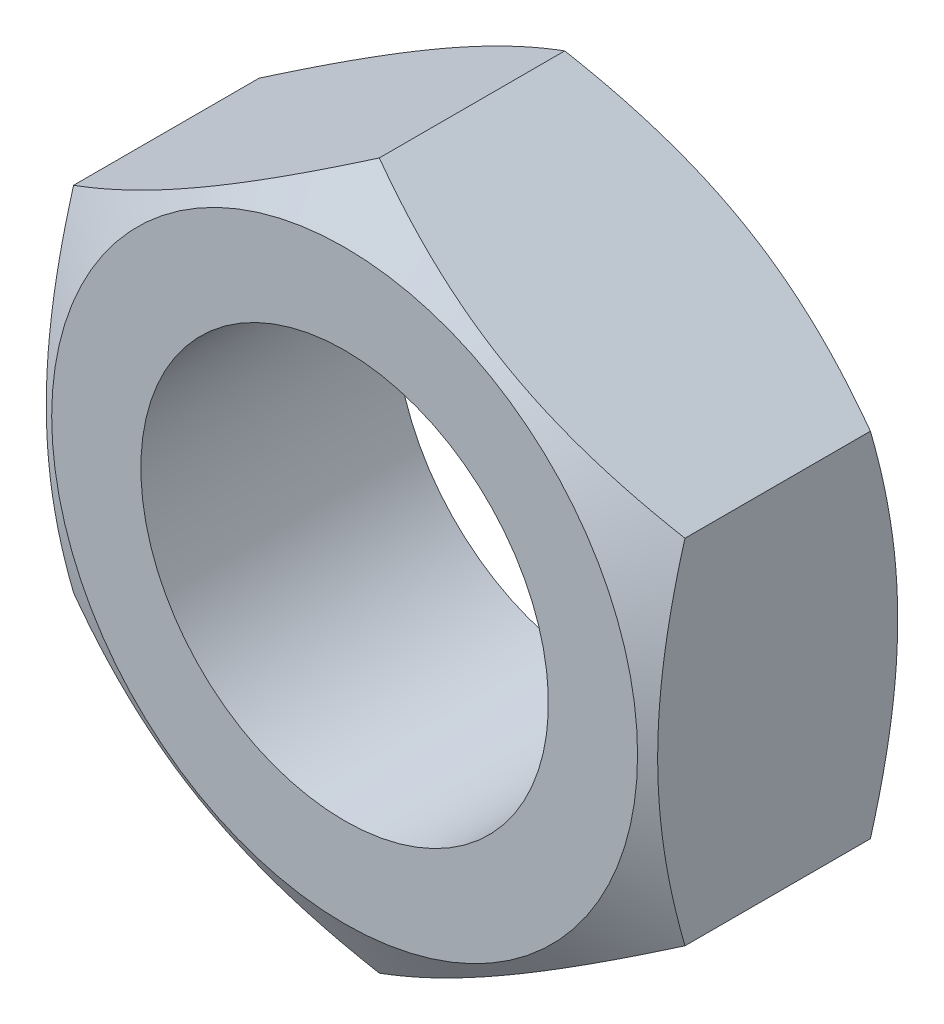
ISO-10303-21;
HEADER;
FILE_DESCRIPTION(('STEP AP214'),'2;1');
FILE_NAME('part.step','',(''),(''),'','','');
FILE_SCHEMA(('AUTOMOTIVE_DESIGN { 1 0 10303 214 1 1 1 1 }'));
ENDSEC;
DATA;
#1=APPLICATION_CONTEXT('core data for automotive mechanical design processes');
#2=APPLICATION_PROTOCOL_DEFINITION('international standard','automotive_design',2000,#1);
#3=PRODUCT_CONTEXT('',#1,'mechanical');
#4=PRODUCT('Part','Part','',(#3));
#5=PRODUCT_RELATED_PRODUCT_CATEGORY('part','',(#4));
#6=PRODUCT_DEFINITION_FORMATION('','',#4);
#7=PRODUCT_DEFINITION_CONTEXT('part definition',#1,'design');
#8=PRODUCT_DEFINITION('design','',#6,#7);
#9=PRODUCT_DEFINITION_SHAPE('','',#8);
#10=(LENGTH_UNIT() NAMED_UNIT(*) SI_UNIT(.MILLI.,.METRE.));
#11=(NAMED_UNIT(*) PLANE_ANGLE_UNIT() SI_UNIT($,.RADIAN.));
#12=(NAMED_UNIT(*) SI_UNIT($,.STERADIAN.) SOLID_ANGLE_UNIT());
#13=UNCERTAINTY_MEASURE_WITH_UNIT(LENGTH_MEASURE(1.E-05),#10,'distance_accuracy_value','');
#14=(GEOMETRIC_REPRESENTATION_CONTEXT(3) GLOBAL_UNCERTAINTY_ASSIGNED_CONTEXT((#13)) GLOBAL_UNIT_ASSIGNED_CONTEXT((#10,
#11,#12)) REPRESENTATION_CONTEXT('',''));
#15=CARTESIAN_POINT('',(0.,0.,0.));
#16=DIRECTION('',(0.,0.,1.));
#17=DIRECTION('',(1.,0.,0.));
#18=AXIS2_PLACEMENT_3D('',#15,#16,#17);
#19=CARTESIAN_POINT('',(-12.,6.92820323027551,0.));
#20=DIRECTION('',(0.,0.,-1.));
#21=DIRECTION('',(0.,-1.,0.));
#22=AXIS2_PLACEMENT_3D('',#19,#20,#21);
#23=PLANE('',#22);
#24=CARTESIAN_POINT('',(0.,0.,0.));
#25=DIRECTION('',(0.,0.,-1.));
#26=DIRECTION('',(0.,-1.,0.));
#27=AXIS2_PLACEMENT_3D('',#24,#25,#26);
#28=CIRCLE('',#27,11.5);
#29=CARTESIAN_POINT('',(0.,-11.5,0.));
#30=VERTEX_POINT('',#29);
#31=EDGE_CURVE('E81',#30,#30,#28,.T.);
#32=ORIENTED_EDGE('',*,*,#31,.T.);
#33=EDGE_LOOP('',(#32));
#34=FACE_BOUND('',#33,.T.);
#35=CARTESIAN_POINT('',(0.,0.,0.));
#36=DIRECTION('',(0.,0.,1.));
#37=DIRECTION('',(0.,1.,0.));
#38=AXIS2_PLACEMENT_3D('',#35,#36,#37);
#39=CIRCLE('',#38,8.);
#40=CARTESIAN_POINT('',(0.,8.,0.));
#41=VERTEX_POINT('',#40);
#42=EDGE_CURVE('E88',#41,#41,#39,.T.);
#43=ORIENTED_EDGE('',*,*,#42,.T.);
#44=EDGE_LOOP('',(#43));
#45=FACE_BOUND('',#44,.T.);
#46=ADVANCED_FACE('F14',(#34,#45),#23,.T.);
#47=CARTESIAN_POINT('',(-12.,-6.92820323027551,13.));
#48=DIRECTION('',(-1.,0.,0.));
#49=DIRECTION('',(0.,0.,1.));
#50=AXIS2_PLACEMENT_3D('',#47,#48,#49);
#51=PLANE('',#50);
#52=CARTESIAN_POINT('',(-12.,-18.5608751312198,3.87883211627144));
#53=CARTESIAN_POINT('',(-12.,-18.2990281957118,4.00578473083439));
#54=CARTESIAN_POINT('',(-12.,-18.0368726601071,4.13210053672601));
#55=CARTESIAN_POINT('',(-12.,-17.51187996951,4.38331420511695));
#56=CARTESIAN_POINT('',(-12.,-17.2490428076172,4.50821205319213));
#57=CARTESIAN_POINT('',(-12.,-16.4593415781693,4.88059540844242));
#58=CARTESIAN_POINT('',(-12.,-15.9313659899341,5.12573269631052));
#59=CARTESIAN_POINT('',(-12.,-14.868968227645,5.60958390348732));
#60=CARTESIAN_POINT('',(-12.,-14.3345265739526,5.84825515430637));
#61=CARTESIAN_POINT('',(-12.,-13.261375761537,6.31576827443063));
#62=CARTESIAN_POINT('',(-12.,-12.7226668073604,6.5446106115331));
#63=CARTESIAN_POINT('',(-12.,-11.6229344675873,6.99693350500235));
#64=CARTESIAN_POINT('',(-12.,-11.0617454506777,7.22001347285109));
#65=CARTESIAN_POINT('',(-12.,-9.93277977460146,7.64917136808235));
#66=CARTESIAN_POINT('',(-12.,-9.36500238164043,7.85524738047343));
#67=CARTESIAN_POINT('',(-12.,-8.22305398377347,8.24494848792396));
#68=CARTESIAN_POINT('',(-12.,-7.64889876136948,8.4286194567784));
#69=CARTESIAN_POINT('',(-12.,-6.49229808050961,8.76759444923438));
#70=CARTESIAN_POINT('',(-12.,-5.90985531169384,8.92290745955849));
#71=CARTESIAN_POINT('',(-12.,-5.03148351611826,9.12854115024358));
#72=CARTESIAN_POINT('',(-12.,-4.73870295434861,9.19239421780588));
#73=CARTESIAN_POINT('',(-12.,-4.15115054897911,9.31022244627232));
#74=CARTESIAN_POINT('',(-12.,-3.85637874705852,9.36419781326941));
#75=CARTESIAN_POINT('',(-12.,-3.26505041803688,9.46131494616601));
#76=CARTESIAN_POINT('',(-12.,-2.96849391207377,9.50445684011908));
#77=CARTESIAN_POINT('',(-12.,-2.37391482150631,9.5790445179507));
#78=CARTESIAN_POINT('',(-12.,-2.07589229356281,9.61049075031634));
#79=CARTESIAN_POINT('',(-12.,-1.48266738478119,9.66067085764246));
#80=CARTESIAN_POINT('',(-12.,-1.18747859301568,9.67956440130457));
#81=CARTESIAN_POINT('',(-12.,-0.596567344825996,9.70485469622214));
#82=CARTESIAN_POINT('',(-12.,-0.300844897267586,9.71125165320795));
#83=CARTESIAN_POINT('',(-12.,0.290606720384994,9.71139681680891));
#84=CARTESIAN_POINT('',(-12.,0.586335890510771,9.7051449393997));
#85=CARTESIAN_POINT('',(-12.,1.17726905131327,9.68014403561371));
#86=CARTESIAN_POINT('',(-12.,1.47247301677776,9.66139442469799));
#87=CARTESIAN_POINT('',(-12.,2.18342491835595,9.60158491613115));
#88=CARTESIAN_POINT('',(-12.,2.5986758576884,9.55451291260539));
#89=CARTESIAN_POINT('',(-12.,3.42606595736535,9.43821515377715));
#90=CARTESIAN_POINT('',(-12.,3.83820468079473,9.3689863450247));
#91=CARTESIAN_POINT('',(-12.,4.65898737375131,9.2108377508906));
#92=CARTESIAN_POINT('',(-12.,5.06762833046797,9.1219024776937));
#93=CARTESIAN_POINT('',(-12.,5.88079652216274,8.92705186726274));
#94=CARTESIAN_POINT('',(-12.,6.28532382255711,8.82113680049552));
#95=CARTESIAN_POINT('',(-12.,7.09914986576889,8.59240044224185));
#96=CARTESIAN_POINT('',(-12.,7.50835787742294,8.46925855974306));
#97=CARTESIAN_POINT('',(-12.,8.32274207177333,8.2103626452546));
#98=CARTESIAN_POINT('',(-12.,8.72791822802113,8.07460853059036));
#99=CARTESIAN_POINT('',(-12.,9.53444110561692,7.7926339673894));
#100=CARTESIAN_POINT('',(-12.,9.93578907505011,7.64641707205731));
#101=CARTESIAN_POINT('',(-12.,10.7351665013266,7.34522628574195));
#102=CARTESIAN_POINT('',(-12.,11.1331959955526,7.19025249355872));
#103=CARTESIAN_POINT('',(-12.,12.0665723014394,6.81689915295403));
#104=CARTESIAN_POINT('',(-12.,12.6007007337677,6.59547839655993));
#105=CARTESIAN_POINT('',(-12.,13.6644716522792,6.14208092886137));
#106=CARTESIAN_POINT('',(-12.,14.1941138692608,5.91010358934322));
#107=CARTESIAN_POINT('',(-12.,15.2497409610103,5.4376919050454));
#108=CARTESIAN_POINT('',(-12.,15.7757250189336,5.19725573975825));
#109=CARTESIAN_POINT('',(-12.,16.8245276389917,4.70961988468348));
#110=CARTESIAN_POINT('',(-12.,17.3473462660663,4.46242033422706));
#111=CARTESIAN_POINT('',(-12.,18.390896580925,3.96224656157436));
#112=CARTESIAN_POINT('',(-12.,18.9116254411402,3.70926645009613));
#113=CARTESIAN_POINT('',(-12.,19.9508536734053,3.19876850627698));
#114=CARTESIAN_POINT('',(-12.,20.4693530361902,2.94125065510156));
#115=CARTESIAN_POINT('',(-12.,21.5043980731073,2.4224824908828));
#116=CARTESIAN_POINT('',(-12.,22.0209439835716,2.16123264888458));
#117=CARTESIAN_POINT('',(-12.,23.0524276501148,1.63557560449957));
#118=CARTESIAN_POINT('',(-12.,23.567365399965,1.37116838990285));
#119=CARTESIAN_POINT('',(-12.,25.0248272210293,0.618038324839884));
#120=CARTESIAN_POINT('',(-12.,25.9657294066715,0.126176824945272));
#121=CARTESIAN_POINT('',(-12.,27.8440416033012,-0.864231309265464));
#122=CARTESIAN_POINT('',(-12.,28.7814514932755,-1.36277817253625));
#123=CARTESIAN_POINT('',(-12.,30.651247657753,-2.36377659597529));
#124=CARTESIAN_POINT('',(-12.,31.5836406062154,-2.86621569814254));
#125=CARTESIAN_POINT('',(-12.,32.9805800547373,-3.62285744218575));
#126=CARTESIAN_POINT('',(-12.,33.4459392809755,-3.87556182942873));
#127=CARTESIAN_POINT('',(-12.,34.3761696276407,-4.38186576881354));
#128=CARTESIAN_POINT('',(-12.,34.8410407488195,-4.63546531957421));
#129=CARTESIAN_POINT('',(-12.,35.3056953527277,-4.88946107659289));
#130=B_SPLINE_CURVE_WITH_KNOTS('',3,(#52,#53,#54,#55,#56,#57,#58,#59,#60,#61,#62,#63,#64,#65,
#66,#67,#68,#69,#70,#71,#72,#73,#74,#75,#76,#77,#78,#79,#80,#81,#82,#83,#84,#85,#86,#87,#88,#89,
#90,#91,#92,#93,#94,#95,#96,#97,#98,#99,#100,#101,#102,#103,#104,#105,#106,#107,#108,#109,#110,
#111,#112,#113,#114,#115,#116,#117,#118,#119,#120,#121,#122,#123,#124,#125,#126,#127,#128,#129),
.UNSPECIFIED.,.F.,.F.,(4,2,2,2,2,2,2,2,2,2,2,2,2,2,2,2,2,2,2,2,2,2,2,2,2,2,2,2,2,2,2,2,2,2,2,2,
2,2,4),(0.,0.872997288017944,1.746003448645,3.49227668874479,5.24813998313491,7.00391961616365,
8.81541564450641,10.6271154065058,12.4350411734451,14.242393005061,15.1412411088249,
16.0400704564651,16.938889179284,17.8376734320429,18.7247944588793,19.6119008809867,
20.4990131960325,21.3861670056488,22.6392038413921,23.8924134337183,25.1466114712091,
26.4007895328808,27.6825510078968,28.964320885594,30.2456575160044,31.5269796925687,
33.2614393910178,34.9960024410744,36.730941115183,38.4658440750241,40.2026011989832,
41.9393655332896,43.6759125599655,45.4124663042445,48.5975507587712,51.7827445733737,
54.960185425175,56.5488219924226,58.1374561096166),.UNSPECIFIED.);
#131=CARTESIAN_POINT('',(-12.,6.92820323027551,8.6395280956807));
#132=VERTEX_POINT('',#131);
#133=CARTESIAN_POINT('',(-12.,-6.92820323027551,8.6395280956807));
#134=VERTEX_POINT('',#133);
#135=EDGE_CURVE('E74',#132,#134,#130,.F.);
#136=ORIENTED_EDGE('',*,*,#135,.F.);
#137=DIRECTION('',(0.,0.,-1.));
#138=VECTOR('',#137,1.);
#139=CARTESIAN_POINT('',(-12.,6.92820323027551,13.));
#140=LINE('',#139,#138);
#141=CARTESIAN_POINT('',(-12.,6.92820323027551,1.36047190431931));
#142=VERTEX_POINT('',#141);
#143=EDGE_CURVE('E43',#132,#142,#140,.T.);
#144=ORIENTED_EDGE('',*,*,#143,.T.);
#145=CARTESIAN_POINT('',(-12.,-18.4544512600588,6.06961259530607));
#146=CARTESIAN_POINT('',(-12.,-18.1930402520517,5.9430868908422));
#147=CARTESIAN_POINT('',(-12.,-17.9313182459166,5.81720403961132));
#148=CARTESIAN_POINT('',(-12.,-17.4071872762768,5.56686996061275));
#149=CARTESIAN_POINT('',(-12.,-17.1447783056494,5.44241874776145));
#150=CARTESIAN_POINT('',(-12.,-16.3563514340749,5.07139761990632));
#151=CARTESIAN_POINT('',(-12.,-15.8292133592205,4.82719894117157));
#152=CARTESIAN_POINT('',(-12.,-14.7684129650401,4.34528329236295));
#153=CARTESIAN_POINT('',(-12.,-14.2347306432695,4.10761024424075));
#154=CARTESIAN_POINT('',(-12.,-13.1630668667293,3.64219712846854));
#155=CARTESIAN_POINT('',(-12.,-12.6250856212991,3.41445658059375));
#156=CARTESIAN_POINT('',(-12.,-11.5272277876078,2.96468396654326));
#157=CARTESIAN_POINT('',(-12.,-10.9671887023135,2.74304643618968));
#158=CARTESIAN_POINT('',(-12.,-9.84049722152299,2.31692491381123));
#159=CARTESIAN_POINT('',(-12.,-9.2738440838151,2.11244286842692));
#160=CARTESIAN_POINT('',(-12.,-8.13415376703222,1.72611748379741));
#161=CARTESIAN_POINT('',(-12.,-7.56113272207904,1.54422693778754));
#162=CARTESIAN_POINT('',(-12.,-6.40681836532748,1.20901403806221));
#163=CARTESIAN_POINT('',(-12.,-5.82552777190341,1.05568251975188));
#164=CARTESIAN_POINT('',(-12.,-4.94889652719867,0.853144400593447));
#165=CARTESIAN_POINT('',(-12.,-4.65667790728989,0.790337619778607));
#166=CARTESIAN_POINT('',(-12.,-4.07027383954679,0.674640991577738));
#167=CARTESIAN_POINT('',(-12.,-3.77608843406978,0.621750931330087));
#168=CARTESIAN_POINT('',(-12.,-3.18596432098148,0.526830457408));
#169=CARTESIAN_POINT('',(-12.,-2.89002562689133,0.484799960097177));
#170=CARTESIAN_POINT('',(-12.,-2.29672200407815,0.412442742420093));
#171=CARTESIAN_POINT('',(-12.,-1.99935712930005,0.38211558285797));
#172=CARTESIAN_POINT('',(-12.,-1.40743040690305,0.334139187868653));
#173=CARTESIAN_POINT('',(-12.,-1.11288138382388,0.316332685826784));
#174=CARTESIAN_POINT('',(-12.,-0.52329545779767,0.293180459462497));
#175=CARTESIAN_POINT('',(-12.,-0.228258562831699,0.28783453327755));
#176=CARTESIAN_POINT('',(-12.,0.36177877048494,0.289730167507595));
#177=CARTESIAN_POINT('',(-12.,0.656779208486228,0.296971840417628));
#178=CARTESIAN_POINT('',(-12.,1.24621730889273,0.323868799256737));
#179=CARTESIAN_POINT('',(-12.,1.54065494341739,0.343524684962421));
#180=CARTESIAN_POINT('',(-12.,2.25305622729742,0.405690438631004));
#181=CARTESIAN_POINT('',(-12.,2.67049186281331,0.45435527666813));
#182=CARTESIAN_POINT('',(-12.,3.50216405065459,0.573948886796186));
#183=CARTESIAN_POINT('',(-12.,3.91640014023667,0.644880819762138));
#184=CARTESIAN_POINT('',(-12.,4.74131306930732,0.806484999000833));
#185=CARTESIAN_POINT('',(-12.,5.15198677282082,0.897173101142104));
#186=CARTESIAN_POINT('',(-12.,5.96916585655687,1.09553152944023));
#187=CARTESIAN_POINT('',(-12.,6.37567130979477,1.20320155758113));
#188=CARTESIAN_POINT('',(-12.,7.19336601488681,1.43543380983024));
#189=CARTESIAN_POINT('',(-12.,7.60446473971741,1.56031259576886));
#190=CARTESIAN_POINT('',(-12.,8.42261104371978,1.8226354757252));
#191=CARTESIAN_POINT('',(-12.,8.82965859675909,1.96007965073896));
#192=CARTESIAN_POINT('',(-12.,9.63990965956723,2.24538065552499));
#193=CARTESIAN_POINT('',(-12.,10.043114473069,2.39323379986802));
#194=CARTESIAN_POINT('',(-12.,10.8462057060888,2.69764647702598));
#195=CARTESIAN_POINT('',(-12.,11.2460921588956,2.85420592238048));
#196=CARTESIAN_POINT('',(-12.,12.1661852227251,3.22413811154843));
#197=CARTESIAN_POINT('',(-12.,12.6853472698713,3.44010450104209));
#198=CARTESIAN_POINT('',(-12.,13.7194599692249,3.88192217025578));
#199=CARTESIAN_POINT('',(-12.,14.2344103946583,4.10777397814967));
#200=CARTESIAN_POINT('',(-12.,15.2608545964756,4.56744547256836));
#201=CARTESIAN_POINT('',(-12.,15.7723476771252,4.80126670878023));
#202=CARTESIAN_POINT('',(-12.,16.7923347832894,5.27532269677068));
#203=CARTESIAN_POINT('',(-12.,17.3008288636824,5.51555733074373));
#204=CARTESIAN_POINT('',(-12.,18.3158028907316,6.00151828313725));
#205=CARTESIAN_POINT('',(-12.,18.8222803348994,6.24724981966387));
#206=CARTESIAN_POINT('',(-12.,19.8331028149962,6.74305920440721));
#207=CARTESIAN_POINT('',(-12.,20.3374478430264,6.99313706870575));
#208=CARTESIAN_POINT('',(-12.,21.3442668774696,7.49688631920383));
#209=CARTESIAN_POINT('',(-12.,21.8467410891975,7.75055729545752));
#210=CARTESIAN_POINT('',(-12.,22.8501391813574,8.2609487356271));
#211=CARTESIAN_POINT('',(-12.,23.3510630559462,8.51766921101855));
#212=CARTESIAN_POINT('',(-12.,24.7719047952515,9.25046361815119));
#213=CARTESIAN_POINT('',(-12.,25.6902386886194,9.72960883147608));
#214=CARTESIAN_POINT('',(-12.,27.5234855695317,10.6944527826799));
#215=CARTESIAN_POINT('',(-12.,28.4383984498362,11.1801517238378));
#216=CARTESIAN_POINT('',(-12.,30.2634394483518,12.1554784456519));
#217=CARTESIAN_POINT('',(-12.,31.1735737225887,12.6450947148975));
#218=CARTESIAN_POINT('',(-12.,32.5371495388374,13.3824670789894));
#219=CARTESIAN_POINT('',(-12.,32.9913926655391,13.6287430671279));
#220=CARTESIAN_POINT('',(-12.,33.8993968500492,14.1221805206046));
#221=CARTESIAN_POINT('',(-12.,34.3531579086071,14.3693419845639));
#222=CARTESIAN_POINT('',(-12.,34.8067047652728,14.6168960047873));
#223=B_SPLINE_CURVE_WITH_KNOTS('',3,(#145,#146,#147,#148,#149,#150,#151,#152,#153,#154,#155,
#156,#157,#158,#159,#160,#161,#162,#163,#164,#165,#166,#167,#168,#169,#170,#171,#172,#173,#174,
#175,#176,#177,#178,#179,#180,#181,#182,#183,#184,#185,#186,#187,#188,#189,#190,#191,#192,#193,
#194,#195,#196,#197,#198,#199,#200,#201,#202,#203,#204,#205,#206,#207,#208,#209,#210,#211,#212,
#213,#214,#215,#216,#217,#218,#219,#220,#221,#222),.UNSPECIFIED.,.F.,.F.,(4,2,2,2,2,2,2,2,2,2,2,
2,2,2,2,2,2,2,2,2,2,2,2,2,2,2,2,2,2,2,2,2,2,2,2,2,2,2,4),(0.,0.871261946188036,1.74253296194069,
3.48534103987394,5.23790247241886,6.99037907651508,8.79706873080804,10.6039631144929,
12.407015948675,14.2094891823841,15.1060240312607,16.002539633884,16.8990483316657,
17.7955233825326,18.6805267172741,19.5655157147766,20.4505126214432,21.3355522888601,
22.5956397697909,23.8559062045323,25.1171878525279,26.3784473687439,27.6671487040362,
28.9558583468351,30.2441139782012,31.532356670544,33.2190919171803,34.9059173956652,
36.5930727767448,38.2801971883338,39.9689975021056,41.6578040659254,43.3464194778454,
45.035041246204,48.1424530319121,51.2499614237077,54.3503701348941,55.9004978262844,
57.4506231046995),.UNSPECIFIED.);
#224=CARTESIAN_POINT('',(-12.,-6.92820323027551,1.36047190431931));
#225=VERTEX_POINT('',#224);
#226=EDGE_CURVE('E93',#225,#142,#223,.T.);
#227=ORIENTED_EDGE('',*,*,#226,.F.);
#228=DIRECTION('',(0.,0.,-1.));
#229=VECTOR('',#228,1.);
#230=CARTESIAN_POINT('',(-12.,-6.92820323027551,13.));
#231=LINE('',#230,#229);
#232=EDGE_CURVE('E80',#134,#225,#231,.T.);
#233=ORIENTED_EDGE('',*,*,#232,.F.);
#234=EDGE_LOOP('',(#136,#144,#227,#233));
#235=FACE_BOUND('',#234,.T.);
#236=ADVANCED_FACE('F79',(#235),#51,.T.);
#237=CARTESIAN_POINT('',(-12.,-6.92820323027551,13.));
#238=DIRECTION('',(0.5,0.86602540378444,0.));
#239=DIRECTION('',(-0.86602540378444,0.5,0.));
#240=AXIS2_PLACEMENT_3D('',#237,#238,#239);
#241=PLANE('',#240);
#242=DIRECTION('',(0.,0.,-1.));
#243=VECTOR('',#242,1.);
#244=CARTESIAN_POINT('',(0.,-13.856406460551,13.));
#245=LINE('',#244,#243);
#246=CARTESIAN_POINT('',(0.,-13.856406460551,8.6395280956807));
#247=VERTEX_POINT('',#246);
#248=CARTESIAN_POINT('',(0.,-13.856406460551,1.3604719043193));
#249=VERTEX_POINT('',#248);
#250=EDGE_CURVE('E100',#247,#249,#245,.T.);
#251=ORIENTED_EDGE('',*,*,#250,.F.);
#252=CARTESIAN_POINT('',(0.000200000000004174,-13.8565219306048,8.63946142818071));
#253=CARTESIAN_POINT('',(-0.26358579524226,-13.7042251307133,8.72737523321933));
#254=CARTESIAN_POINT('',(-0.528355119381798,-13.5513604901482,8.81129886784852));
#255=CARTESIAN_POINT('',(-1.06001701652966,-13.244405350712,8.97005864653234));
#256=CARTESIAN_POINT('',(-1.32691025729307,-13.0903144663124,9.0448918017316));
#257=CARTESIAN_POINT('',(-2.13189040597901,-12.6255589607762,9.25430732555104));
#258=CARTESIAN_POINT('',(-2.6731550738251,-12.3130596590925,9.37342162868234));
#259=CARTESIAN_POINT('',(-3.483132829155,-11.8454187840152,9.51309380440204));
#260=CARTESIAN_POINT('',(-3.74942610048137,-11.6916742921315,9.55288106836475));
#261=CARTESIAN_POINT('',(-4.28324559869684,-11.3834734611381,9.6196014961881));
#262=CARTESIAN_POINT('',(-4.55077184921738,-11.2290171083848,9.64653441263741));
#263=CARTESIAN_POINT('',(-5.08627036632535,-10.9198468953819,9.68685627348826));
#264=CARTESIAN_POINT('',(-5.35424172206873,-10.7651335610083,9.70026131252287));
#265=CARTESIAN_POINT('',(-5.89043273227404,-10.4555635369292,9.71324177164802));
#266=CARTESIAN_POINT('',(-6.15865237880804,-10.3007068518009,9.71281761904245));
#267=CARTESIAN_POINT('',(-6.66008937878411,-10.011202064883,9.69910484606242));
#268=CARTESIAN_POINT('',(-6.89334249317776,-9.87653331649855,9.68748888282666));
#269=CARTESIAN_POINT('',(-7.35931224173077,-9.60750555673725,9.65401685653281));
#270=CARTESIAN_POINT('',(-7.59202883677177,-9.47314656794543,9.63216006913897));
#271=CARTESIAN_POINT('',(-8.05679907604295,-9.20481134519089,9.57858744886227));
#272=CARTESIAN_POINT('',(-8.28885201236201,-9.07083551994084,9.54686347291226));
#273=CARTESIAN_POINT('',(-8.75186996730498,-8.80351197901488,9.47411308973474));
#274=CARTESIAN_POINT('',(-8.98283491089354,-8.67016430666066,9.43308605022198));
#275=CARTESIAN_POINT('',(-9.68394195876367,-8.2653799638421,9.29501321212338));
#276=CARTESIAN_POINT('',(-10.1520537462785,-7.99511549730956,9.18419997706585));
#277=CARTESIAN_POINT('',(-11.0812971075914,-7.45861659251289,8.93269909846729));
#278=CARTESIAN_POINT('',(-11.5424405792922,-7.19237528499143,8.79207052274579));
#279=CARTESIAN_POINT('',(-12.0002,-6.92808776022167,8.6394614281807));
#280=B_SPLINE_CURVE_WITH_KNOTS('',3,(#252,#253,#254,#255,#256,#257,#258,#259,#260,#261,#262,
#263,#264,#265,#266,#267,#268,#269,#270,#271,#272,#273,#274,#275,#276,#277,#278,#279),
.UNSPECIFIED.,.F.,.F.,(4,2,2,2,2,2,2,2,2,2,2,2,2,4),(0.,0.951004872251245,1.90232158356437,
3.80900466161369,4.7389455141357,5.6689042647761,6.59775529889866,7.5265776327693,
8.33514643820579,9.14377244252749,9.95306755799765,10.7624176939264,12.4167102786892,
14.0677556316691),.UNSPECIFIED.);
#281=EDGE_CURVE('E82',#247,#134,#280,.T.);
#282=ORIENTED_EDGE('',*,*,#281,.T.);
#283=ORIENTED_EDGE('',*,*,#232,.T.);
#284=CARTESIAN_POINT('',(-12.0002,-6.92808776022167,1.3605385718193));
#285=CARTESIAN_POINT('',(-11.7364142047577,-7.08038456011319,1.27262476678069));
#286=CARTESIAN_POINT('',(-11.4716448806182,-7.23324920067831,1.18870113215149));
#287=CARTESIAN_POINT('',(-10.9399829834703,-7.54020434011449,1.02994135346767));
#288=CARTESIAN_POINT('',(-10.6730897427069,-7.69429522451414,0.955108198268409));
#289=CARTESIAN_POINT('',(-9.86810959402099,-8.15905073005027,0.745692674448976));
#290=CARTESIAN_POINT('',(-9.32684492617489,-8.47155003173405,0.626578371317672));
#291=CARTESIAN_POINT('',(-8.516867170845,-8.93919090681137,0.486906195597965));
#292=CARTESIAN_POINT('',(-8.25057389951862,-9.09293539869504,0.447118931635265));
#293=CARTESIAN_POINT('',(-7.71675440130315,-9.40113622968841,0.380398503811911));
#294=CARTESIAN_POINT('',(-7.44922815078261,-9.55559258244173,0.353465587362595));
#295=CARTESIAN_POINT('',(-6.91372963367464,-9.86476279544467,0.313143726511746));
#296=CARTESIAN_POINT('',(-6.64575827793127,-10.0194761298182,0.29973868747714));
#297=CARTESIAN_POINT('',(-6.10956726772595,-10.3290461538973,0.286758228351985));
#298=CARTESIAN_POINT('',(-5.84134762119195,-10.4839028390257,0.287182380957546));
#299=CARTESIAN_POINT('',(-5.33991062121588,-10.7734076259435,0.300895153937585));
#300=CARTESIAN_POINT('',(-5.10665750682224,-10.908076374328,0.312511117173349));
#301=CARTESIAN_POINT('',(-4.64068775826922,-11.1771041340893,0.345983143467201));
#302=CARTESIAN_POINT('',(-4.40797116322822,-11.3114631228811,0.367839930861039));
#303=CARTESIAN_POINT('',(-3.94320092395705,-11.5797983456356,0.42141255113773));
#304=CARTESIAN_POINT('',(-3.71114798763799,-11.7137741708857,0.453136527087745));
#305=CARTESIAN_POINT('',(-3.24813003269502,-11.9810977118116,0.525886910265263));
#306=CARTESIAN_POINT('',(-3.01716508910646,-12.1144453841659,0.56691394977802));
#307=CARTESIAN_POINT('',(-2.31605804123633,-12.5192297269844,0.704986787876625));
#308=CARTESIAN_POINT('',(-1.84794625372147,-12.789494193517,0.815800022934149));
#309=CARTESIAN_POINT('',(-0.918702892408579,-13.3259930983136,1.06730090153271));
#310=CARTESIAN_POINT('',(-0.457559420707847,-13.5922344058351,1.20792947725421));
#311=CARTESIAN_POINT('',(0.000199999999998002,-13.8565219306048,1.3605385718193));
#312=B_SPLINE_CURVE_WITH_KNOTS('',3,(#284,#285,#286,#287,#288,#289,#290,#291,#292,#293,#294,
#295,#296,#297,#298,#299,#300,#301,#302,#303,#304,#305,#306,#307,#308,#309,#310,#311),
.UNSPECIFIED.,.F.,.F.,(4,2,2,2,2,2,2,2,2,2,2,2,2,4),(0.,0.951004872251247,1.90232158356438,
3.80900466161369,4.73894551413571,5.6689042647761,6.59775529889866,7.52657763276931,
8.3351464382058,9.1437724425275,9.95306755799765,10.7624176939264,12.4167102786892,
14.0677556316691),.UNSPECIFIED.);
#313=EDGE_CURVE('E147',#225,#249,#312,.T.);
#314=ORIENTED_EDGE('',*,*,#313,.T.);
#315=EDGE_LOOP('',(#251,#282,#283,#314));
#316=FACE_BOUND('',#315,.T.);
#317=ADVANCED_FACE('F16',(#316),#241,.F.);
#318=CARTESIAN_POINT('',(12.,-6.9282032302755,13.));
#319=DIRECTION('',(0.5,-0.866025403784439,0.));
#320=DIRECTION('',(0.86602540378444,0.5,0.));
#321=AXIS2_PLACEMENT_3D('',#318,#319,#320);
#322=PLANE('',#321);
#323=CARTESIAN_POINT('',(-0.000199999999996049,-13.8565219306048,8.63946142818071));
#324=CARTESIAN_POINT('',(0.263585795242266,-13.7042251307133,8.72737523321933));
#325=CARTESIAN_POINT('',(0.528355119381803,-13.5513604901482,8.81129886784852));
#326=CARTESIAN_POINT('',(1.06001701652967,-13.244405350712,8.97005864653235));
#327=CARTESIAN_POINT('',(1.32691025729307,-13.0903144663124,9.04489180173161));
#328=CARTESIAN_POINT('',(2.13189040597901,-12.6255589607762,9.25430732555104));
#329=CARTESIAN_POINT('',(2.67315507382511,-12.3130596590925,9.37342162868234));
#330=CARTESIAN_POINT('',(3.483132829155,-11.8454187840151,9.51309380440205));
#331=CARTESIAN_POINT('',(3.74942610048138,-11.6916742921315,9.55288106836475));
#332=CARTESIAN_POINT('',(4.28324559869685,-11.3834734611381,9.6196014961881));
#333=CARTESIAN_POINT('',(4.55077184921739,-11.2290171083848,9.64653441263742));
#334=CARTESIAN_POINT('',(5.08627036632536,-10.9198468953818,9.68685627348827));
#335=CARTESIAN_POINT('',(5.35424172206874,-10.7651335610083,9.70026131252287));
#336=CARTESIAN_POINT('',(5.89043273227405,-10.4555635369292,9.71324177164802));
#337=CARTESIAN_POINT('',(6.15865237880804,-10.3007068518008,9.71281761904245));
#338=CARTESIAN_POINT('',(6.66008937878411,-10.011202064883,9.69910484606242));
#339=CARTESIAN_POINT('',(6.89334249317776,-9.87653331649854,9.68748888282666));
#340=CARTESIAN_POINT('',(7.35931224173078,-9.60750555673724,9.65401685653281));
#341=CARTESIAN_POINT('',(7.59202883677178,-9.47314656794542,9.63216006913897));
#342=CARTESIAN_POINT('',(8.05679907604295,-9.20481134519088,9.57858744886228));
#343=CARTESIAN_POINT('',(8.28885201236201,-9.07083551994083,9.54686347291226));
#344=CARTESIAN_POINT('',(8.75186996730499,-8.80351197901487,9.47411308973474));
#345=CARTESIAN_POINT('',(8.98283491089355,-8.67016430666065,9.43308605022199));
#346=CARTESIAN_POINT('',(9.68394195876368,-8.26537996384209,9.29501321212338));
#347=CARTESIAN_POINT('',(10.1520537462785,-7.99511549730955,9.18419997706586));
#348=CARTESIAN_POINT('',(11.0812971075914,-7.45861659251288,8.9326990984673));
#349=CARTESIAN_POINT('',(11.5424405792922,-7.19237528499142,8.7920705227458));
#350=CARTESIAN_POINT('',(12.0002,-6.92808776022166,8.6394614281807));
#351=B_SPLINE_CURVE_WITH_KNOTS('',3,(#323,#324,#325,#326,#327,#328,#329,#330,#331,#332,#333,
#334,#335,#336,#337,#338,#339,#340,#341,#342,#343,#344,#345,#346,#347,#348,#349,#350),
.UNSPECIFIED.,.F.,.F.,(4,2,2,2,2,2,2,2,2,2,2,2,2,4),(0.,0.951004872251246,1.90232158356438,
3.80900466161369,4.73894551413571,5.6689042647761,6.59775529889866,7.52657763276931,
8.33514643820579,9.1437724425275,9.95306755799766,10.7624176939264,12.4167102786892,
14.0677556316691),.UNSPECIFIED.);
#352=CARTESIAN_POINT('',(12.,-6.9282032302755,8.6395280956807));
#353=VERTEX_POINT('',#352);
#354=EDGE_CURVE('E189',#247,#353,#351,.T.);
#355=ORIENTED_EDGE('',*,*,#354,.F.);
#356=ORIENTED_EDGE('',*,*,#250,.T.);
#357=CARTESIAN_POINT('',(12.0002,-6.92808776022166,1.3605385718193));
#358=CARTESIAN_POINT('',(11.7364142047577,-7.08038456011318,1.27262476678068));
#359=CARTESIAN_POINT('',(11.4716448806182,-7.2332492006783,1.18870113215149));
#360=CARTESIAN_POINT('',(10.9399829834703,-7.54020434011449,1.02994135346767));
#361=CARTESIAN_POINT('',(10.6730897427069,-7.69429522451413,0.955108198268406));
#362=CARTESIAN_POINT('',(9.86810959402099,-8.15905073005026,0.745692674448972));
#363=CARTESIAN_POINT('',(9.32684492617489,-8.47155003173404,0.626578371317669));
#364=CARTESIAN_POINT('',(8.516867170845,-8.93919090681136,0.486906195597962));
#365=CARTESIAN_POINT('',(8.25057389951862,-9.09293539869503,0.447118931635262));
#366=CARTESIAN_POINT('',(7.71675440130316,-9.4011362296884,0.380398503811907));
#367=CARTESIAN_POINT('',(7.44922815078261,-9.55559258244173,0.353465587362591));
#368=CARTESIAN_POINT('',(6.91372963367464,-9.86476279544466,0.313143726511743));
#369=CARTESIAN_POINT('',(6.64575827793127,-10.0194761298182,0.299738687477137));
#370=CARTESIAN_POINT('',(6.10956726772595,-10.3290461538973,0.286758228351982));
#371=CARTESIAN_POINT('',(5.84134762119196,-10.4839028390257,0.287182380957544));
#372=CARTESIAN_POINT('',(5.33991062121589,-10.7734076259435,0.300895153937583));
#373=CARTESIAN_POINT('',(5.10665750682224,-10.908076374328,0.312511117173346));
#374=CARTESIAN_POINT('',(4.64068775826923,-11.1771041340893,0.345983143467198));
#375=CARTESIAN_POINT('',(4.40797116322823,-11.3114631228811,0.367839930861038));
#376=CARTESIAN_POINT('',(3.94320092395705,-11.5797983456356,0.421412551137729));
#377=CARTESIAN_POINT('',(3.711147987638,-11.7137741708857,0.453136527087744));
#378=CARTESIAN_POINT('',(3.24813003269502,-11.9810977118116,0.525886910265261));
#379=CARTESIAN_POINT('',(3.01716508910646,-12.1144453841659,0.566913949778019));
#380=CARTESIAN_POINT('',(2.31605804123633,-12.5192297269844,0.704986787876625));
#381=CARTESIAN_POINT('',(1.84794625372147,-12.789494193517,0.815800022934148));
#382=CARTESIAN_POINT('',(0.918702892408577,-13.3259930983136,1.06730090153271));
#383=CARTESIAN_POINT('',(0.457559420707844,-13.5922344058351,1.2079294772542));
#384=CARTESIAN_POINT('',(-0.000199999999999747,-13.8565219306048,1.3605385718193));
#385=B_SPLINE_CURVE_WITH_KNOTS('',3,(#357,#358,#359,#360,#361,#362,#363,#364,#365,#366,#367,
#368,#369,#370,#371,#372,#373,#374,#375,#376,#377,#378,#379,#380,#381,#382,#383,#384),
.UNSPECIFIED.,.F.,.F.,(4,2,2,2,2,2,2,2,2,2,2,2,2,4),(0.,0.951004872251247,1.90232158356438,
3.80900466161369,4.73894551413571,5.6689042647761,6.59775529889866,7.52657763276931,
8.33514643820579,9.1437724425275,9.95306755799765,10.7624176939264,12.4167102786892,
14.0677556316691),.UNSPECIFIED.);
#386=CARTESIAN_POINT('',(12.,-6.9282032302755,1.36047190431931));
#387=VERTEX_POINT('',#386);
#388=EDGE_CURVE('E141',#387,#249,#385,.T.);
#389=ORIENTED_EDGE('',*,*,#388,.F.);
#390=DIRECTION('',(0.,0.,-1.));
#391=VECTOR('',#390,1.);
#392=CARTESIAN_POINT('',(12.,-6.9282032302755,13.));
#393=LINE('',#392,#391);
#394=EDGE_CURVE('E98',#353,#387,#393,.T.);
#395=ORIENTED_EDGE('',*,*,#394,.F.);
#396=EDGE_LOOP('',(#355,#356,#389,#395));
#397=FACE_BOUND('',#396,.T.);
#398=ADVANCED_FACE('F194',(#397),#322,.T.);
#399=CARTESIAN_POINT('',(12.,-6.9282032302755,13.));
#400=DIRECTION('',(-1.,0.,0.));
#401=DIRECTION('',(0.,0.,1.));
#402=AXIS2_PLACEMENT_3D('',#399,#400,#401);
#403=PLANE('',#402);
#404=DIRECTION('',(0.,0.,-1.));
#405=VECTOR('',#404,1.);
#406=CARTESIAN_POINT('',(12.,6.92820323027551,13.));
#407=LINE('',#406,#405);
#408=CARTESIAN_POINT('',(12.,6.92820323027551,8.6395280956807));
#409=VERTEX_POINT('',#408);
#410=CARTESIAN_POINT('',(12.,6.92820323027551,1.36047190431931));
#411=VERTEX_POINT('',#410);
#412=EDGE_CURVE('E90',#409,#411,#407,.T.);
#413=ORIENTED_EDGE('',*,*,#412,.F.);
#414=CARTESIAN_POINT('',(12.,-18.5608751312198,3.87883211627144));
#415=CARTESIAN_POINT('',(12.,-18.2990281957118,4.00578473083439));
#416=CARTESIAN_POINT('',(12.,-18.0368726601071,4.13210053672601));
#417=CARTESIAN_POINT('',(12.,-17.51187996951,4.38331420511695));
#418=CARTESIAN_POINT('',(12.,-17.2490428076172,4.50821205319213));
#419=CARTESIAN_POINT('',(12.,-16.4593415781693,4.88059540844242));
#420=CARTESIAN_POINT('',(12.,-15.9313659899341,5.12573269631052));
#421=CARTESIAN_POINT('',(12.,-14.868968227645,5.60958390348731));
#422=CARTESIAN_POINT('',(12.,-14.3345265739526,5.84825515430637));
#423=CARTESIAN_POINT('',(12.,-13.261375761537,6.31576827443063));
#424=CARTESIAN_POINT('',(12.,-12.7226668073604,6.5446106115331));
#425=CARTESIAN_POINT('',(12.,-11.6229344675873,6.99693350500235));
#426=CARTESIAN_POINT('',(12.,-11.0617454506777,7.22001347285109));
#427=CARTESIAN_POINT('',(12.,-9.93277977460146,7.64917136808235));
#428=CARTESIAN_POINT('',(12.,-9.36500238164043,7.85524738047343));
#429=CARTESIAN_POINT('',(12.,-8.22305398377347,8.24494848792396));
#430=CARTESIAN_POINT('',(12.,-7.64889876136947,8.4286194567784));
#431=CARTESIAN_POINT('',(12.,-6.49229808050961,8.76759444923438));
#432=CARTESIAN_POINT('',(12.,-5.90985531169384,8.92290745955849));
#433=CARTESIAN_POINT('',(12.,-5.03148351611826,9.12854115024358));
#434=CARTESIAN_POINT('',(12.,-4.73870295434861,9.19239421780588));
#435=CARTESIAN_POINT('',(12.,-4.15115054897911,9.31022244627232));
#436=CARTESIAN_POINT('',(12.,-3.85637874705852,9.36419781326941));
#437=CARTESIAN_POINT('',(12.,-3.26505041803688,9.46131494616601));
#438=CARTESIAN_POINT('',(12.,-2.96849391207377,9.50445684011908));
#439=CARTESIAN_POINT('',(12.,-2.37391482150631,9.5790445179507));
#440=CARTESIAN_POINT('',(12.,-2.07589229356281,9.61049075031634));
#441=CARTESIAN_POINT('',(12.,-1.48266738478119,9.66067085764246));
#442=CARTESIAN_POINT('',(12.,-1.18747859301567,9.67956440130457));
#443=CARTESIAN_POINT('',(12.,-0.59656734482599,9.70485469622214));
#444=CARTESIAN_POINT('',(12.,-0.30084489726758,9.71125165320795));
#445=CARTESIAN_POINT('',(12.,0.290606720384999,9.71139681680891));
#446=CARTESIAN_POINT('',(12.,0.586335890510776,9.7051449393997));
#447=CARTESIAN_POINT('',(12.,1.17726905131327,9.68014403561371));
#448=CARTESIAN_POINT('',(12.,1.47247301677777,9.66139442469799));
#449=CARTESIAN_POINT('',(12.,2.18342491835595,9.60158491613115));
#450=CARTESIAN_POINT('',(12.,2.5986758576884,9.55451291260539));
#451=CARTESIAN_POINT('',(12.,3.42606595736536,9.43821515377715));
#452=CARTESIAN_POINT('',(12.,3.83820468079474,9.36898634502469));
#453=CARTESIAN_POINT('',(12.,4.65898737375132,9.2108377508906));
#454=CARTESIAN_POINT('',(12.,5.06762833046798,9.1219024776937));
#455=CARTESIAN_POINT('',(12.,5.88079652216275,8.92705186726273));
#456=CARTESIAN_POINT('',(12.,6.28532382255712,8.82113680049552));
#457=CARTESIAN_POINT('',(12.,7.0991498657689,8.59240044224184));
#458=CARTESIAN_POINT('',(12.,7.50835787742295,8.46925855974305));
#459=CARTESIAN_POINT('',(12.,8.32274207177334,8.21036264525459));
#460=CARTESIAN_POINT('',(12.,8.72791822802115,8.07460853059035));
#461=CARTESIAN_POINT('',(12.,9.53444110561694,7.79263396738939));
#462=CARTESIAN_POINT('',(12.,9.93578907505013,7.6464170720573));
#463=CARTESIAN_POINT('',(12.,10.7351665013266,7.34522628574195));
#464=CARTESIAN_POINT('',(12.,11.1331959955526,7.19025249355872));
#465=CARTESIAN_POINT('',(12.,12.0665723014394,6.81689915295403));
#466=CARTESIAN_POINT('',(12.,12.6007007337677,6.59547839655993));
#467=CARTESIAN_POINT('',(12.,13.6644716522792,6.14208092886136));
#468=CARTESIAN_POINT('',(12.,14.1941138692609,5.91010358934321));
#469=CARTESIAN_POINT('',(12.,15.2497409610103,5.4376919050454));
#470=CARTESIAN_POINT('',(12.,15.7757250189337,5.19725573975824));
#471=CARTESIAN_POINT('',(12.,16.8245276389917,4.70961988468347));
#472=CARTESIAN_POINT('',(12.,17.3473462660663,4.46242033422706));
#473=CARTESIAN_POINT('',(12.,18.390896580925,3.96224656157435));
#474=CARTESIAN_POINT('',(12.,18.9116254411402,3.70926645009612));
#475=CARTESIAN_POINT('',(12.,19.9508536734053,3.19876850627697));
#476=CARTESIAN_POINT('',(12.,20.4693530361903,2.94125065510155));
#477=CARTESIAN_POINT('',(12.,21.5043980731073,2.42248249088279));
#478=CARTESIAN_POINT('',(12.,22.0209439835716,2.16123264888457));
#479=CARTESIAN_POINT('',(12.,23.0524276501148,1.63557560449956));
#480=CARTESIAN_POINT('',(12.,23.567365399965,1.37116838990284));
#481=CARTESIAN_POINT('',(12.,25.0248272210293,0.618038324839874));
#482=CARTESIAN_POINT('',(12.,25.9657294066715,0.126176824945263));
#483=CARTESIAN_POINT('',(12.,27.8440416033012,-0.86423130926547));
#484=CARTESIAN_POINT('',(12.,28.7814514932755,-1.36277817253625));
#485=CARTESIAN_POINT('',(12.,30.651247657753,-2.36377659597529));
#486=CARTESIAN_POINT('',(12.,31.5836406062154,-2.86621569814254));
#487=CARTESIAN_POINT('',(12.,32.9805800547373,-3.62285744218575));
#488=CARTESIAN_POINT('',(12.,33.4459392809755,-3.87556182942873));
#489=CARTESIAN_POINT('',(12.,34.3761696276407,-4.38186576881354));
#490=CARTESIAN_POINT('',(12.,34.8410407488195,-4.63546531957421));
#491=CARTESIAN_POINT('',(12.,35.3056953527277,-4.88946107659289));
#492=B_SPLINE_CURVE_WITH_KNOTS('',3,(#414,#415,#416,#417,#418,#419,#420,#421,#422,#423,#424,
#425,#426,#427,#428,#429,#430,#431,#432,#433,#434,#435,#436,#437,#438,#439,#440,#441,#442,#443,
#444,#445,#446,#447,#448,#449,#450,#451,#452,#453,#454,#455,#456,#457,#458,#459,#460,#461,#462,
#463,#464,#465,#466,#467,#468,#469,#470,#471,#472,#473,#474,#475,#476,#477,#478,#479,#480,#481,
#482,#483,#484,#485,#486,#487,#488,#489,#490,#491),.UNSPECIFIED.,.F.,.F.,(4,2,2,2,2,2,2,2,2,2,2,
2,2,2,2,2,2,2,2,2,2,2,2,2,2,2,2,2,2,2,2,2,2,2,2,2,2,2,4),(0.,0.872997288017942,1.746003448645,
3.49227668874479,5.24813998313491,7.00391961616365,8.81541564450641,10.6271154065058,
12.4350411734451,14.242393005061,15.1412411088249,16.0400704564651,16.938889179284,
17.837673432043,18.7247944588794,19.6119008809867,20.4990131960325,21.3861670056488,
22.6392038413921,23.8924134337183,25.1466114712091,26.4007895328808,27.6825510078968,
28.964320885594,30.2456575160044,31.5269796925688,33.2614393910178,34.9960024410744,
36.730941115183,38.4658440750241,40.2026011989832,41.9393655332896,43.6759125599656,
45.4124663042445,48.5975507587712,51.7827445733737,54.960185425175,56.5488219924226,
58.1374561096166),.UNSPECIFIED.);
#493=EDGE_CURVE('E184',#409,#353,#492,.F.);
#494=ORIENTED_EDGE('',*,*,#493,.T.);
#495=ORIENTED_EDGE('',*,*,#394,.T.);
#496=CARTESIAN_POINT('',(12.,-18.4544512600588,6.06961259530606));
#497=CARTESIAN_POINT('',(12.,-18.1930402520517,5.94308689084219));
#498=CARTESIAN_POINT('',(12.,-17.9313182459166,5.8172040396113));
#499=CARTESIAN_POINT('',(12.,-17.4071872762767,5.56686996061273));
#500=CARTESIAN_POINT('',(12.,-17.1447783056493,5.44241874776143));
#501=CARTESIAN_POINT('',(12.,-16.3563514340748,5.07139761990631));
#502=CARTESIAN_POINT('',(12.,-15.8292133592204,4.82719894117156));
#503=CARTESIAN_POINT('',(12.,-14.76841296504,4.34528329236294));
#504=CARTESIAN_POINT('',(12.,-14.2347306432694,4.10761024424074));
#505=CARTESIAN_POINT('',(12.,-13.1630668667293,3.64219712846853));
#506=CARTESIAN_POINT('',(12.,-12.6250856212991,3.41445658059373));
#507=CARTESIAN_POINT('',(12.,-11.5272277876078,2.96468396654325));
#508=CARTESIAN_POINT('',(12.,-10.9671887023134,2.74304643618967));
#509=CARTESIAN_POINT('',(12.,-9.84049722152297,2.31692491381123));
#510=CARTESIAN_POINT('',(12.,-9.27384408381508,2.11244286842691));
#511=CARTESIAN_POINT('',(12.,-8.1341537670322,1.72611748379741));
#512=CARTESIAN_POINT('',(12.,-7.56113272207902,1.54422693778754));
#513=CARTESIAN_POINT('',(12.,-6.40681836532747,1.2090140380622));
#514=CARTESIAN_POINT('',(12.,-5.8255277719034,1.05568251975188));
#515=CARTESIAN_POINT('',(12.,-4.94889652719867,0.853144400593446));
#516=CARTESIAN_POINT('',(12.,-4.65667790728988,0.790337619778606));
#517=CARTESIAN_POINT('',(12.,-4.07027383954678,0.674640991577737));
#518=CARTESIAN_POINT('',(12.,-3.77608843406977,0.621750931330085));
#519=CARTESIAN_POINT('',(12.,-3.18596432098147,0.526830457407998));
#520=CARTESIAN_POINT('',(12.,-2.89002562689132,0.484799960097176));
#521=CARTESIAN_POINT('',(12.,-2.29672200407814,0.412442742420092));
#522=CARTESIAN_POINT('',(12.,-1.99935712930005,0.38211558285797));
#523=CARTESIAN_POINT('',(12.,-1.40743040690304,0.334139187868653));
#524=CARTESIAN_POINT('',(12.,-1.11288138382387,0.316332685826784));
#525=CARTESIAN_POINT('',(12.,-0.523295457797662,0.293180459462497));
#526=CARTESIAN_POINT('',(12.,-0.228258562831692,0.28783453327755));
#527=CARTESIAN_POINT('',(12.,0.361778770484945,0.289730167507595));
#528=CARTESIAN_POINT('',(12.,0.656779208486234,0.296971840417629));
#529=CARTESIAN_POINT('',(12.,1.24621730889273,0.323868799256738));
#530=CARTESIAN_POINT('',(12.,1.54065494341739,0.343524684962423));
#531=CARTESIAN_POINT('',(12.,2.25305622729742,0.405690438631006));
#532=CARTESIAN_POINT('',(12.,2.67049186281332,0.454355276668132));
#533=CARTESIAN_POINT('',(12.,3.50216405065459,0.573948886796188));
#534=CARTESIAN_POINT('',(12.,3.91640014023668,0.644880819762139));
#535=CARTESIAN_POINT('',(12.,4.74131306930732,0.806484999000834));
#536=CARTESIAN_POINT('',(12.,5.15198677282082,0.897173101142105));
#537=CARTESIAN_POINT('',(12.,5.96916585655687,1.09553152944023));
#538=CARTESIAN_POINT('',(12.,6.37567130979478,1.20320155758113));
#539=CARTESIAN_POINT('',(12.,7.19336601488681,1.43543380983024));
#540=CARTESIAN_POINT('',(12.,7.60446473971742,1.56031259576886));
#541=CARTESIAN_POINT('',(12.,8.42261104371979,1.8226354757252));
#542=CARTESIAN_POINT('',(12.,8.8296585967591,1.96007965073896));
#543=CARTESIAN_POINT('',(12.,9.63990965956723,2.24538065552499));
#544=CARTESIAN_POINT('',(12.,10.043114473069,2.39323379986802));
#545=CARTESIAN_POINT('',(12.,10.8462057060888,2.69764647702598));
#546=CARTESIAN_POINT('',(12.,11.2460921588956,2.85420592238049));
#547=CARTESIAN_POINT('',(12.,12.1661852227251,3.22413811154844));
#548=CARTESIAN_POINT('',(12.,12.6853472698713,3.44010450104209));
#549=CARTESIAN_POINT('',(12.,13.7194599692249,3.88192217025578));
#550=CARTESIAN_POINT('',(12.,14.2344103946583,4.10777397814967));
#551=CARTESIAN_POINT('',(12.,15.2608545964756,4.56744547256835));
#552=CARTESIAN_POINT('',(12.,15.7723476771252,4.80126670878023));
#553=CARTESIAN_POINT('',(12.,16.7923347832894,5.27532269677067));
#554=CARTESIAN_POINT('',(12.,17.3008288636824,5.51555733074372));
#555=CARTESIAN_POINT('',(12.,18.3158028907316,6.00151828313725));
#556=CARTESIAN_POINT('',(12.,18.8222803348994,6.24724981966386));
#557=CARTESIAN_POINT('',(12.,19.8331028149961,6.7430592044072));
#558=CARTESIAN_POINT('',(12.,20.3374478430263,6.99313706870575));
#559=CARTESIAN_POINT('',(12.,21.3442668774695,7.49688631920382));
#560=CARTESIAN_POINT('',(12.,21.8467410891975,7.75055729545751));
#561=CARTESIAN_POINT('',(12.,22.8501391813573,8.26094873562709));
#562=CARTESIAN_POINT('',(12.,23.3510630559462,8.51766921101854));
#563=CARTESIAN_POINT('',(12.,24.7719047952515,9.25046361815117));
#564=CARTESIAN_POINT('',(12.,25.6902386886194,9.72960883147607));
#565=CARTESIAN_POINT('',(12.,27.5234855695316,10.6944527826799));
#566=CARTESIAN_POINT('',(12.,28.4383984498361,11.1801517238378));
#567=CARTESIAN_POINT('',(12.,30.2634394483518,12.1554784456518));
#568=CARTESIAN_POINT('',(12.,31.1735737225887,12.6450947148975));
#569=CARTESIAN_POINT('',(12.,32.5371495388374,13.3824670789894));
#570=CARTESIAN_POINT('',(12.,32.991392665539,13.6287430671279));
#571=CARTESIAN_POINT('',(12.,33.8993968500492,14.1221805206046));
#572=CARTESIAN_POINT('',(12.,34.353157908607,14.3693419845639));
#573=CARTESIAN_POINT('',(12.,34.8067047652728,14.6168960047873));
#574=B_SPLINE_CURVE_WITH_KNOTS('',3,(#496,#497,#498,#499,#500,#501,#502,#503,#504,#505,#506,
#507,#508,#509,#510,#511,#512,#513,#514,#515,#516,#517,#518,#519,#520,#521,#522,#523,#524,#525,
#526,#527,#528,#529,#530,#531,#532,#533,#534,#535,#536,#537,#538,#539,#540,#541,#542,#543,#544,
#545,#546,#547,#548,#549,#550,#551,#552,#553,#554,#555,#556,#557,#558,#559,#560,#561,#562,#563,
#564,#565,#566,#567,#568,#569,#570,#571,#572,#573),.UNSPECIFIED.,.F.,.F.,(4,2,2,2,2,2,2,2,2,2,2,
2,2,2,2,2,2,2,2,2,2,2,2,2,2,2,2,2,2,2,2,2,2,2,2,2,2,2,4),(0.,0.871261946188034,1.74253296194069,
3.48534103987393,5.23790247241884,6.99037907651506,8.79706873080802,10.6039631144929,
12.407015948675,14.209489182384,15.1060240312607,16.002539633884,16.8990483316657,
17.7955233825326,18.680526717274,19.5655157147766,20.4505126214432,21.33555228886,
22.5956397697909,23.8559062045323,25.1171878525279,26.3784473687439,27.6671487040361,
28.955858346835,30.2441139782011,31.532356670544,33.2190919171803,34.9059173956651,
36.5930727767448,38.2801971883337,39.9689975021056,41.6578040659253,43.3464194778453,
45.0350412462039,48.142453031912,51.2499614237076,54.350370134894,55.9004978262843,
57.4506231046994),.UNSPECIFIED.);
#575=EDGE_CURVE('E134',#387,#411,#574,.T.);
#576=ORIENTED_EDGE('',*,*,#575,.T.);
#577=EDGE_LOOP('',(#413,#494,#495,#576));
#578=FACE_BOUND('',#577,.T.);
#579=ADVANCED_FACE('F197',(#578),#403,.F.);
#580=CARTESIAN_POINT('',(12.,6.92820323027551,13.));
#581=DIRECTION('',(-0.5,-0.86602540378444,0.));
#582=DIRECTION('',(0.86602540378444,-0.5,0.));
#583=AXIS2_PLACEMENT_3D('',#580,#581,#582);
#584=PLANE('',#583);
#585=DIRECTION('',(0.,0.,-1.));
#586=VECTOR('',#585,1.);
#587=CARTESIAN_POINT('',(0.,13.856406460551,13.));
#588=LINE('',#587,#586);
#589=CARTESIAN_POINT('',(0.,13.856406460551,8.63952809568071));
#590=VERTEX_POINT('',#589);
#591=CARTESIAN_POINT('',(0.,13.856406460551,1.3604719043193));
#592=VERTEX_POINT('',#591);
#593=EDGE_CURVE('E87',#590,#592,#588,.T.);
#594=ORIENTED_EDGE('',*,*,#593,.F.);
#595=CARTESIAN_POINT('',(-0.000200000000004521,13.8565219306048,8.63946142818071));
#596=CARTESIAN_POINT('',(0.26358579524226,13.7042251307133,8.72737523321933));
#597=CARTESIAN_POINT('',(0.528355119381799,13.5513604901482,8.81129886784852));
#598=CARTESIAN_POINT('',(1.06001701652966,13.244405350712,8.97005864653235));
#599=CARTESIAN_POINT('',(1.32691025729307,13.0903144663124,9.0448918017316));
#600=CARTESIAN_POINT('',(2.13189040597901,12.6255589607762,9.25430732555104));
#601=CARTESIAN_POINT('',(2.6731550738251,12.3130596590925,9.37342162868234));
#602=CARTESIAN_POINT('',(3.483132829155,11.8454187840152,9.51309380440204));
#603=CARTESIAN_POINT('',(3.74942610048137,11.6916742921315,9.55288106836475));
#604=CARTESIAN_POINT('',(4.28324559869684,11.3834734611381,9.6196014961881));
#605=CARTESIAN_POINT('',(4.55077184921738,11.2290171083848,9.64653441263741));
#606=CARTESIAN_POINT('',(5.08627036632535,10.9198468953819,9.68685627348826));
#607=CARTESIAN_POINT('',(5.35424172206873,10.7651335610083,9.70026131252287));
#608=CARTESIAN_POINT('',(5.89043273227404,10.4555635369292,9.71324177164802));
#609=CARTESIAN_POINT('',(6.15865237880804,10.3007068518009,9.71281761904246));
#610=CARTESIAN_POINT('',(6.66008937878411,10.011202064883,9.69910484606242));
#611=CARTESIAN_POINT('',(6.89334249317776,9.87653331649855,9.68748888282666));
#612=CARTESIAN_POINT('',(7.35931224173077,9.60750555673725,9.65401685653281));
#613=CARTESIAN_POINT('',(7.59202883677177,9.47314656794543,9.63216006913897));
#614=CARTESIAN_POINT('',(8.05679907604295,9.20481134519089,9.57858744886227));
#615=CARTESIAN_POINT('',(8.28885201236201,9.07083551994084,9.54686347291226));
#616=CARTESIAN_POINT('',(8.75186996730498,8.80351197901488,9.47411308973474));
#617=CARTESIAN_POINT('',(8.98283491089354,8.67016430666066,9.43308605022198));
#618=CARTESIAN_POINT('',(9.68394195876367,8.2653799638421,9.29501321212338));
#619=CARTESIAN_POINT('',(10.1520537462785,7.99511549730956,9.18419997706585));
#620=CARTESIAN_POINT('',(11.0812971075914,7.45861659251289,8.9326990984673));
#621=CARTESIAN_POINT('',(11.5424405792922,7.19237528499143,8.79207052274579));
#622=CARTESIAN_POINT('',(12.0002,6.92808776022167,8.6394614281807));
#623=B_SPLINE_CURVE_WITH_KNOTS('',3,(#595,#596,#597,#598,#599,#600,#601,#602,#603,#604,#605,
#606,#607,#608,#609,#610,#611,#612,#613,#614,#615,#616,#617,#618,#619,#620,#621,#622),
.UNSPECIFIED.,.F.,.F.,(4,2,2,2,2,2,2,2,2,2,2,2,2,4),(0.,0.951004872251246,1.90232158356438,
3.80900466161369,4.7389455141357,5.66890426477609,6.59775529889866,7.52657763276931,
8.33514643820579,9.1437724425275,9.95306755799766,10.7624176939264,12.4167102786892,
14.0677556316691),.UNSPECIFIED.);
#624=EDGE_CURVE('E35',#590,#409,#623,.T.);
#625=ORIENTED_EDGE('',*,*,#624,.T.);
#626=ORIENTED_EDGE('',*,*,#412,.T.);
#627=CARTESIAN_POINT('',(12.0002,6.92808776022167,1.3605385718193));
#628=CARTESIAN_POINT('',(11.7364142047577,7.08038456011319,1.27262476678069));
#629=CARTESIAN_POINT('',(11.4716448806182,7.23324920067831,1.18870113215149));
#630=CARTESIAN_POINT('',(10.9399829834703,7.54020434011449,1.02994135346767));
#631=CARTESIAN_POINT('',(10.6730897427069,7.69429522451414,0.955108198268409));
#632=CARTESIAN_POINT('',(9.86810959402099,8.15905073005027,0.745692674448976));
#633=CARTESIAN_POINT('',(9.32684492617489,8.47155003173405,0.626578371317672));
#634=CARTESIAN_POINT('',(8.516867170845,8.93919090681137,0.486906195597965));
#635=CARTESIAN_POINT('',(8.25057389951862,9.09293539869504,0.447118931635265));
#636=CARTESIAN_POINT('',(7.71675440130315,9.40113622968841,0.380398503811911));
#637=CARTESIAN_POINT('',(7.44922815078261,9.55559258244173,0.353465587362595));
#638=CARTESIAN_POINT('',(6.91372963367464,9.86476279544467,0.313143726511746));
#639=CARTESIAN_POINT('',(6.64575827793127,10.0194761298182,0.29973868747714));
#640=CARTESIAN_POINT('',(6.10956726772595,10.3290461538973,0.286758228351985));
#641=CARTESIAN_POINT('',(5.84134762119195,10.4839028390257,0.287182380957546));
#642=CARTESIAN_POINT('',(5.33991062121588,10.7734076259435,0.300895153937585));
#643=CARTESIAN_POINT('',(5.10665750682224,10.908076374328,0.312511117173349));
#644=CARTESIAN_POINT('',(4.64068775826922,11.1771041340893,0.345983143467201));
#645=CARTESIAN_POINT('',(4.40797116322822,11.3114631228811,0.367839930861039));
#646=CARTESIAN_POINT('',(3.94320092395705,11.5797983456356,0.42141255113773));
#647=CARTESIAN_POINT('',(3.71114798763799,11.7137741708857,0.453136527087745));
#648=CARTESIAN_POINT('',(3.24813003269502,11.9810977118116,0.525886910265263));
#649=CARTESIAN_POINT('',(3.01716508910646,12.1144453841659,0.56691394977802));
#650=CARTESIAN_POINT('',(2.31605804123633,12.5192297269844,0.704986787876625));
#651=CARTESIAN_POINT('',(1.84794625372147,12.789494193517,0.815800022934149));
#652=CARTESIAN_POINT('',(0.918702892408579,13.3259930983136,1.06730090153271));
#653=CARTESIAN_POINT('',(0.457559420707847,13.5922344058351,1.20792947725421));
#654=CARTESIAN_POINT('',(-0.000199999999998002,13.8565219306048,1.3605385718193));
#655=B_SPLINE_CURVE_WITH_KNOTS('',3,(#627,#628,#629,#630,#631,#632,#633,#634,#635,#636,#637,
#638,#639,#640,#641,#642,#643,#644,#645,#646,#647,#648,#649,#650,#651,#652,#653,#654),
.UNSPECIFIED.,.F.,.F.,(4,2,2,2,2,2,2,2,2,2,2,2,2,4),(0.,0.951004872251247,1.90232158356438,
3.80900466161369,4.73894551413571,5.6689042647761,6.59775529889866,7.52657763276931,
8.3351464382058,9.1437724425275,9.95306755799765,10.7624176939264,12.4167102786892,
14.0677556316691),.UNSPECIFIED.);
#656=EDGE_CURVE('E126',#411,#592,#655,.T.);
#657=ORIENTED_EDGE('',*,*,#656,.T.);
#658=EDGE_LOOP('',(#594,#625,#626,#657));
#659=FACE_BOUND('',#658,.T.);
#660=ADVANCED_FACE('F202',(#659),#584,.F.);
#661=CARTESIAN_POINT('',(-12.,6.92820323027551,13.));
#662=DIRECTION('',(-0.5,0.86602540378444,0.));
#663=DIRECTION('',(-0.86602540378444,-0.5,0.));
#664=AXIS2_PLACEMENT_3D('',#661,#662,#663);
#665=PLANE('',#664);
#666=CARTESIAN_POINT('',(0.000200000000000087,13.8565219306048,8.63946142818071));
#667=CARTESIAN_POINT('',(-0.263585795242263,13.7042251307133,8.72737523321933));
#668=CARTESIAN_POINT('',(-0.528355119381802,13.5513604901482,8.81129886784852));
#669=CARTESIAN_POINT('',(-1.06001701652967,13.244405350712,8.97005864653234));
#670=CARTESIAN_POINT('',(-1.32691025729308,13.0903144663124,9.0448918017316));
#671=CARTESIAN_POINT('',(-2.13189040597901,12.6255589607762,9.25430732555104));
#672=CARTESIAN_POINT('',(-2.67315507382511,12.3130596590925,9.37342162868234));
#673=CARTESIAN_POINT('',(-3.483132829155,11.8454187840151,9.51309380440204));
#674=CARTESIAN_POINT('',(-3.74942610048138,11.6916742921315,9.55288106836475));
#675=CARTESIAN_POINT('',(-4.28324559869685,11.3834734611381,9.6196014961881));
#676=CARTESIAN_POINT('',(-4.55077184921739,11.2290171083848,9.64653441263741));
#677=CARTESIAN_POINT('',(-5.08627036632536,10.9198468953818,9.68685627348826));
#678=CARTESIAN_POINT('',(-5.35424172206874,10.7651335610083,9.70026131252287));
#679=CARTESIAN_POINT('',(-5.89043273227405,10.4555635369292,9.71324177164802));
#680=CARTESIAN_POINT('',(-6.15865237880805,10.3007068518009,9.71281761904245));
#681=CARTESIAN_POINT('',(-6.66008937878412,10.011202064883,9.69910484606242));
#682=CARTESIAN_POINT('',(-6.89334249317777,9.87653331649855,9.68748888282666));
#683=CARTESIAN_POINT('',(-7.35931224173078,9.60750555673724,9.65401685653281));
#684=CARTESIAN_POINT('',(-7.59202883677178,9.47314656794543,9.63216006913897));
#685=CARTESIAN_POINT('',(-8.05679907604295,9.20481134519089,9.57858744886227));
#686=CARTESIAN_POINT('',(-8.28885201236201,9.07083551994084,9.54686347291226));
#687=CARTESIAN_POINT('',(-8.75186996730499,8.80351197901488,9.47411308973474));
#688=CARTESIAN_POINT('',(-8.98283491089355,8.67016430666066,9.43308605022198));
#689=CARTESIAN_POINT('',(-9.68394195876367,8.2653799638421,9.29501321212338));
#690=CARTESIAN_POINT('',(-10.1520537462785,7.99511549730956,9.18419997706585));
#691=CARTESIAN_POINT('',(-11.0812971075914,7.45861659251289,8.93269909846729));
#692=CARTESIAN_POINT('',(-11.5424405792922,7.19237528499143,8.79207052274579));
#693=CARTESIAN_POINT('',(-12.0002,6.92808776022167,8.6394614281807));
#694=B_SPLINE_CURVE_WITH_KNOTS('',3,(#666,#667,#668,#669,#670,#671,#672,#673,#674,#675,#676,
#677,#678,#679,#680,#681,#682,#683,#684,#685,#686,#687,#688,#689,#690,#691,#692,#693),
.UNSPECIFIED.,.F.,.F.,(4,2,2,2,2,2,2,2,2,2,2,2,2,4),(0.,0.951004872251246,1.90232158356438,
3.80900466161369,4.73894551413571,5.6689042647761,6.59775529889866,7.52657763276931,
8.33514643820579,9.1437724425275,9.95306755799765,10.7624176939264,12.4167102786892,
14.0677556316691),.UNSPECIFIED.);
#695=EDGE_CURVE('E9',#590,#132,#694,.T.);
#696=ORIENTED_EDGE('',*,*,#695,.F.);
#697=ORIENTED_EDGE('',*,*,#593,.T.);
#698=CARTESIAN_POINT('',(-12.0002,6.92808776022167,1.3605385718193));
#699=CARTESIAN_POINT('',(-11.7364142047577,7.08038456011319,1.27262476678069));
#700=CARTESIAN_POINT('',(-11.4716448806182,7.23324920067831,1.18870113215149));
#701=CARTESIAN_POINT('',(-10.9399829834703,7.54020434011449,1.02994135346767));
#702=CARTESIAN_POINT('',(-10.6730897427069,7.69429522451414,0.955108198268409));
#703=CARTESIAN_POINT('',(-9.86810959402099,8.15905073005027,0.745692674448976));
#704=CARTESIAN_POINT('',(-9.32684492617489,8.47155003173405,0.626578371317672));
#705=CARTESIAN_POINT('',(-8.516867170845,8.93919090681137,0.486906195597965));
#706=CARTESIAN_POINT('',(-8.25057389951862,9.09293539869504,0.447118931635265));
#707=CARTESIAN_POINT('',(-7.71675440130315,9.40113622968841,0.380398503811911));
#708=CARTESIAN_POINT('',(-7.44922815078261,9.55559258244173,0.353465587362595));
#709=CARTESIAN_POINT('',(-6.91372963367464,9.86476279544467,0.313143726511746));
#710=CARTESIAN_POINT('',(-6.64575827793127,10.0194761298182,0.29973868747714));
#711=CARTESIAN_POINT('',(-6.10956726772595,10.3290461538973,0.286758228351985));
#712=CARTESIAN_POINT('',(-5.84134762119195,10.4839028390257,0.287182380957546));
#713=CARTESIAN_POINT('',(-5.33991062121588,10.7734076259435,0.300895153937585));
#714=CARTESIAN_POINT('',(-5.10665750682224,10.908076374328,0.312511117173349));
#715=CARTESIAN_POINT('',(-4.64068775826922,11.1771041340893,0.345983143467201));
#716=CARTESIAN_POINT('',(-4.40797116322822,11.3114631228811,0.367839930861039));
#717=CARTESIAN_POINT('',(-3.94320092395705,11.5797983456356,0.42141255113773));
#718=CARTESIAN_POINT('',(-3.71114798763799,11.7137741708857,0.453136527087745));
#719=CARTESIAN_POINT('',(-3.24813003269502,11.9810977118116,0.525886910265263));
#720=CARTESIAN_POINT('',(-3.01716508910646,12.1144453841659,0.56691394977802));
#721=CARTESIAN_POINT('',(-2.31605804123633,12.5192297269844,0.704986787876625));
#722=CARTESIAN_POINT('',(-1.84794625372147,12.789494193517,0.815800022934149));
#723=CARTESIAN_POINT('',(-0.918702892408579,13.3259930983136,1.06730090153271));
#724=CARTESIAN_POINT('',(-0.457559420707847,13.5922344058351,1.20792947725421));
#725=CARTESIAN_POINT('',(0.000199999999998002,13.8565219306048,1.3605385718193));
#726=B_SPLINE_CURVE_WITH_KNOTS('',3,(#698,#699,#700,#701,#702,#703,#704,#705,#706,#707,#708,
#709,#710,#711,#712,#713,#714,#715,#716,#717,#718,#719,#720,#721,#722,#723,#724,#725),
.UNSPECIFIED.,.F.,.F.,(4,2,2,2,2,2,2,2,2,2,2,2,2,4),(0.,0.951004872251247,1.90232158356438,
3.80900466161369,4.73894551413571,5.6689042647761,6.59775529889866,7.52657763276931,
8.3351464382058,9.1437724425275,9.95306755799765,10.7624176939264,12.4167102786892,
14.0677556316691),.UNSPECIFIED.);
#727=EDGE_CURVE('E29',#142,#592,#726,.T.);
#728=ORIENTED_EDGE('',*,*,#727,.F.);
#729=ORIENTED_EDGE('',*,*,#143,.F.);
#730=EDGE_LOOP('',(#696,#697,#728,#729));
#731=FACE_BOUND('',#730,.T.);
#732=ADVANCED_FACE('F85',(#731),#665,.T.);
#733=CARTESIAN_POINT('',(0.,0.,13.));
#734=DIRECTION('',(0.,0.,-1.));
#735=DIRECTION('',(0.,-1.,0.));
#736=AXIS2_PLACEMENT_3D('',#733,#734,#735);
#737=CYLINDRICAL_SURFACE('',#736,8.);
#738=CARTESIAN_POINT('',(0.,0.,10.));
#739=DIRECTION('',(0.,0.,-1.));
#740=DIRECTION('',(0.,-1.,0.));
#741=AXIS2_PLACEMENT_3D('',#738,#739,#740);
#742=CIRCLE('',#741,8.);
#743=CARTESIAN_POINT('',(0.,-8.,10.));
#744=VERTEX_POINT('',#743);
#745=EDGE_CURVE('E108',#744,#744,#742,.T.);
#746=ORIENTED_EDGE('',*,*,#745,.F.);
#747=EDGE_LOOP('',(#746));
#748=FACE_BOUND('',#747,.T.);
#749=ORIENTED_EDGE('',*,*,#42,.F.);
#750=EDGE_LOOP('',(#749));
#751=FACE_BOUND('',#750,.T.);
#752=ADVANCED_FACE('F118',(#748,#751),#737,.F.);
#753=CARTESIAN_POINT('',(0.,0.,2.22387201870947));
#754=DIRECTION('',(0.,0.,1.));
#755=DIRECTION('',(0.,1.,0.));
#756=AXIS2_PLACEMENT_3D('',#753,#754,#755);
#757=CONICAL_SURFACE('',#756,15.3518593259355,1.0471975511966);
#758=ORIENTED_EDGE('',*,*,#226,.T.);
#759=ORIENTED_EDGE('',*,*,#727,.T.);
#760=ORIENTED_EDGE('',*,*,#656,.F.);
#761=ORIENTED_EDGE('',*,*,#575,.F.);
#762=ORIENTED_EDGE('',*,*,#388,.T.);
#763=ORIENTED_EDGE('',*,*,#313,.F.);
#764=EDGE_LOOP('',(#758,#759,#760,#761,#762,#763));
#765=FACE_BOUND('',#764,.T.);
#766=ORIENTED_EDGE('',*,*,#31,.F.);
#767=EDGE_LOOP('',(#766));
#768=FACE_BOUND('',#767,.T.);
#769=ADVANCED_FACE('F112',(#765,#768),#757,.T.);
#770=CARTESIAN_POINT('',(0.,0.,10.));
#771=DIRECTION('',(0.,0.,-1.));
#772=DIRECTION('',(0.,-1.,0.));
#773=AXIS2_PLACEMENT_3D('',#770,#771,#772);
#774=PLANE('',#773);
#775=ORIENTED_EDGE('',*,*,#745,.T.);
#776=EDGE_LOOP('',(#775));
#777=FACE_BOUND('',#776,.T.);
#778=CARTESIAN_POINT('',(0.,0.,10.));
#779=DIRECTION('',(0.,0.,-1.));
#780=DIRECTION('',(0.,-1.,0.));
#781=AXIS2_PLACEMENT_3D('',#778,#779,#780);
#782=CIRCLE('',#781,11.5);
#783=CARTESIAN_POINT('',(0.,-11.5,10.));
#784=VERTEX_POINT('',#783);
#785=EDGE_CURVE('E232',#784,#784,#782,.T.);
#786=ORIENTED_EDGE('',*,*,#785,.F.);
#787=EDGE_LOOP('',(#786));
#788=FACE_BOUND('',#787,.T.);
#789=ADVANCED_FACE('F117',(#777,#788),#774,.F.);
#790=CARTESIAN_POINT('',(0.,0.,10.));
#791=DIRECTION('',(0.,0.,-1.));
#792=DIRECTION('',(0.,-1.,0.));
#793=AXIS2_PLACEMENT_3D('',#790,#791,#792);
#794=CONICAL_SURFACE('',#793,11.5,1.0471975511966);
#795=ORIENTED_EDGE('',*,*,#135,.T.);
#796=ORIENTED_EDGE('',*,*,#281,.F.);
#797=ORIENTED_EDGE('',*,*,#354,.T.);
#798=ORIENTED_EDGE('',*,*,#493,.F.);
#799=ORIENTED_EDGE('',*,*,#624,.F.);
#800=ORIENTED_EDGE('',*,*,#695,.T.);
#801=EDGE_LOOP('',(#795,#796,#797,#798,#799,#800));
#802=FACE_BOUND('',#801,.T.);
#803=ORIENTED_EDGE('',*,*,#785,.T.);
#804=EDGE_LOOP('',(#803));
#805=FACE_BOUND('',#804,.T.);
#806=ADVANCED_FACE('F72',(#802,#805),#794,.T.);
#807=CLOSED_SHELL('',(#46,#236,#317,#398,#579,#660,#732,#752,#769,#789,#806));
#808=MANIFOLD_SOLID_BREP('B1',#807);
#809=ADVANCED_BREP_SHAPE_REPRESENTATION('',(#18,#808),#14);
#810=SHAPE_DEFINITION_REPRESENTATION(#9,#809);
ENDSEC;
END-ISO-10303-21;
